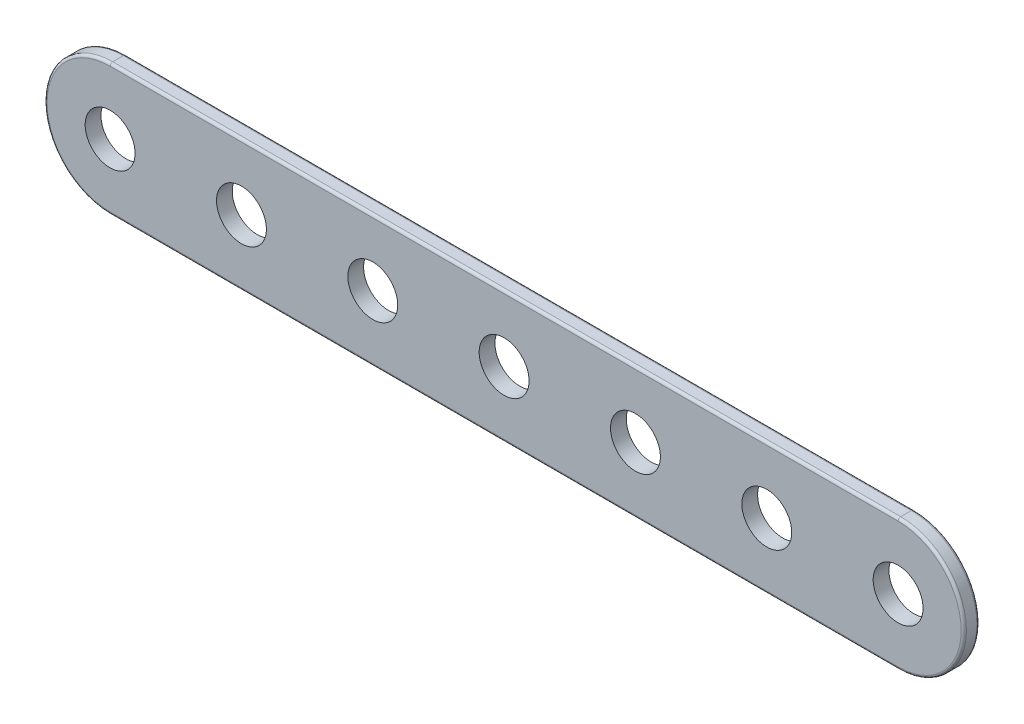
ISO-10303-21;
HEADER;
FILE_DESCRIPTION(('STEP AP214'),'2;1');
FILE_NAME('part.step','',(''),(''),'','','');
FILE_SCHEMA(('AUTOMOTIVE_DESIGN { 1 0 10303 214 1 1 1 1 }'));
ENDSEC;
DATA;
#1=APPLICATION_CONTEXT('core data for automotive mechanical design processes');
#2=APPLICATION_PROTOCOL_DEFINITION('international standard','automotive_design',2000,#1);
#3=PRODUCT_CONTEXT('',#1,'mechanical');
#4=PRODUCT('Part','Part','',(#3));
#5=PRODUCT_RELATED_PRODUCT_CATEGORY('part','',(#4));
#6=PRODUCT_DEFINITION_FORMATION('','',#4);
#7=PRODUCT_DEFINITION_CONTEXT('part definition',#1,'design');
#8=PRODUCT_DEFINITION('design','',#6,#7);
#9=PRODUCT_DEFINITION_SHAPE('','',#8);
#10=(LENGTH_UNIT() NAMED_UNIT(*) SI_UNIT(.MILLI.,.METRE.));
#11=(NAMED_UNIT(*) PLANE_ANGLE_UNIT() SI_UNIT($,.RADIAN.));
#12=(NAMED_UNIT(*) SI_UNIT($,.STERADIAN.) SOLID_ANGLE_UNIT());
#13=UNCERTAINTY_MEASURE_WITH_UNIT(LENGTH_MEASURE(1.E-05),#10,'distance_accuracy_value','');
#14=(GEOMETRIC_REPRESENTATION_CONTEXT(3) GLOBAL_UNCERTAINTY_ASSIGNED_CONTEXT((#13)) GLOBAL_UNIT_ASSIGNED_CONTEXT((#10,
#11,#12)) REPRESENTATION_CONTEXT('',''));
#15=CARTESIAN_POINT('',(0.,0.,0.));
#16=DIRECTION('',(0.,0.,1.));
#17=DIRECTION('',(1.,0.,0.));
#18=AXIS2_PLACEMENT_3D('',#15,#16,#17);
#19=CARTESIAN_POINT('',(38.1,0.,1.524));
#20=DIRECTION('',(0.,0.,-1.));
#21=DIRECTION('',(-1.,0.,0.));
#22=AXIS2_PLACEMENT_3D('',#19,#20,#21);
#23=CYLINDRICAL_SURFACE('',#22,6.35);
#24=DIRECTION('',(0.,0.,-1.));
#25=VECTOR('',#24,1.);
#26=CARTESIAN_POINT('',(38.1,-6.35,1.524));
#27=LINE('',#26,#25);
#28=CARTESIAN_POINT('',(38.1,-6.35,1.27));
#29=VERTEX_POINT('',#28);
#30=CARTESIAN_POINT('',(38.1,-6.35,0.254000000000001));
#31=VERTEX_POINT('',#30);
#32=EDGE_CURVE('E199',#29,#31,#27,.T.);
#33=ORIENTED_EDGE('',*,*,#32,.T.);
#34=CARTESIAN_POINT('',(38.1,0.,0.254));
#35=DIRECTION('',(0.,0.,-1.));
#36=DIRECTION('',(-1.,0.,0.));
#37=AXIS2_PLACEMENT_3D('',#34,#35,#36);
#38=CIRCLE('',#37,6.35);
#39=CARTESIAN_POINT('',(38.1,6.35000000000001,0.254000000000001));
#40=VERTEX_POINT('',#39);
#41=EDGE_CURVE('E118',#31,#40,#38,.F.);
#42=ORIENTED_EDGE('',*,*,#41,.T.);
#43=DIRECTION('',(0.,0.,-1.));
#44=VECTOR('',#43,1.);
#45=CARTESIAN_POINT('',(38.1,6.35000000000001,1.524));
#46=LINE('',#45,#44);
#47=CARTESIAN_POINT('',(38.1,6.35000000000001,1.27));
#48=VERTEX_POINT('',#47);
#49=EDGE_CURVE('E101',#48,#40,#46,.T.);
#50=ORIENTED_EDGE('',*,*,#49,.F.);
#51=CARTESIAN_POINT('',(38.1,0.,1.27));
#52=DIRECTION('',(0.,0.,-1.));
#53=DIRECTION('',(-1.,0.,0.));
#54=AXIS2_PLACEMENT_3D('',#51,#52,#53);
#55=CIRCLE('',#54,6.35);
#56=EDGE_CURVE('E115',#48,#29,#55,.T.);
#57=ORIENTED_EDGE('',*,*,#56,.T.);
#58=EDGE_LOOP('',(#33,#42,#50,#57));
#59=FACE_BOUND('',#58,.T.);
#60=ADVANCED_FACE('F32',(#59),#23,.T.);
#61=CARTESIAN_POINT('',(-38.1,6.35000000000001,1.524));
#62=DIRECTION('',(0.,-1.,0.));
#63=DIRECTION('',(0.,0.,-1.));
#64=AXIS2_PLACEMENT_3D('',#61,#62,#63);
#65=PLANE('',#64);
#66=ORIENTED_EDGE('',*,*,#49,.T.);
#67=DIRECTION('',(-1.,0.,0.));
#68=VECTOR('',#67,1.);
#69=CARTESIAN_POINT('',(-38.1,6.35000000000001,0.254));
#70=LINE('',#69,#68);
#71=CARTESIAN_POINT('',(-38.1,6.35000000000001,0.254000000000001));
#72=VERTEX_POINT('',#71);
#73=EDGE_CURVE('E11',#40,#72,#70,.T.);
#74=ORIENTED_EDGE('',*,*,#73,.T.);
#75=DIRECTION('',(0.,0.,-1.));
#76=VECTOR('',#75,1.);
#77=CARTESIAN_POINT('',(-38.1,6.35000000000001,1.524));
#78=LINE('',#77,#76);
#79=CARTESIAN_POINT('',(-38.1,6.35000000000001,1.27));
#80=VERTEX_POINT('',#79);
#81=EDGE_CURVE('E103',#80,#72,#78,.T.);
#82=ORIENTED_EDGE('',*,*,#81,.F.);
#83=DIRECTION('',(-1.,0.,0.));
#84=VECTOR('',#83,1.);
#85=CARTESIAN_POINT('',(-38.1,6.35000000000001,1.27));
#86=LINE('',#85,#84);
#87=EDGE_CURVE('E41',#80,#48,#86,.F.);
#88=ORIENTED_EDGE('',*,*,#87,.T.);
#89=EDGE_LOOP('',(#66,#74,#82,#88));
#90=FACE_BOUND('',#89,.T.);
#91=ADVANCED_FACE('F100',(#90),#65,.F.);
#92=CARTESIAN_POINT('',(-38.1,0.,1.524));
#93=DIRECTION('',(0.,0.,-1.));
#94=DIRECTION('',(-1.,0.,0.));
#95=AXIS2_PLACEMENT_3D('',#92,#93,#94);
#96=CYLINDRICAL_SURFACE('',#95,6.35);
#97=ORIENTED_EDGE('',*,*,#81,.T.);
#98=CARTESIAN_POINT('',(-38.1,0.,0.254));
#99=DIRECTION('',(0.,0.,-1.));
#100=DIRECTION('',(-1.,0.,0.));
#101=AXIS2_PLACEMENT_3D('',#98,#99,#100);
#102=CIRCLE('',#101,6.35);
#103=CARTESIAN_POINT('',(-38.1,-6.35,0.254000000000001));
#104=VERTEX_POINT('',#103);
#105=EDGE_CURVE('E223',#72,#104,#102,.F.);
#106=ORIENTED_EDGE('',*,*,#105,.T.);
#107=DIRECTION('',(0.,0.,-1.));
#108=VECTOR('',#107,1.);
#109=CARTESIAN_POINT('',(-38.1,-6.35,1.524));
#110=LINE('',#109,#108);
#111=CARTESIAN_POINT('',(-38.1,-6.35,1.27));
#112=VERTEX_POINT('',#111);
#113=EDGE_CURVE('E203',#112,#104,#110,.T.);
#114=ORIENTED_EDGE('',*,*,#113,.F.);
#115=CARTESIAN_POINT('',(-38.1,0.,1.27));
#116=DIRECTION('',(0.,0.,-1.));
#117=DIRECTION('',(-1.,0.,0.));
#118=AXIS2_PLACEMENT_3D('',#115,#116,#117);
#119=CIRCLE('',#118,6.35);
#120=EDGE_CURVE('E221',#112,#80,#119,.T.);
#121=ORIENTED_EDGE('',*,*,#120,.T.);
#122=EDGE_LOOP('',(#97,#106,#114,#121));
#123=FACE_BOUND('',#122,.T.);
#124=ADVANCED_FACE('F237',(#123),#96,.T.);
#125=CARTESIAN_POINT('',(-38.1,-6.35,1.524));
#126=DIRECTION('',(0.,1.,0.));
#127=DIRECTION('',(0.,0.,1.));
#128=AXIS2_PLACEMENT_3D('',#125,#126,#127);
#129=PLANE('',#128);
#130=ORIENTED_EDGE('',*,*,#113,.T.);
#131=DIRECTION('',(1.,0.,0.));
#132=VECTOR('',#131,1.);
#133=CARTESIAN_POINT('',(38.1,-6.35,0.254));
#134=LINE('',#133,#132);
#135=EDGE_CURVE('E219',#104,#31,#134,.T.);
#136=ORIENTED_EDGE('',*,*,#135,.T.);
#137=ORIENTED_EDGE('',*,*,#32,.F.);
#138=DIRECTION('',(1.,0.,0.));
#139=VECTOR('',#138,1.);
#140=CARTESIAN_POINT('',(-38.1,-6.35,1.27));
#141=LINE('',#140,#139);
#142=EDGE_CURVE('E217',#29,#112,#141,.F.);
#143=ORIENTED_EDGE('',*,*,#142,.T.);
#144=EDGE_LOOP('',(#130,#136,#137,#143));
#145=FACE_BOUND('',#144,.T.);
#146=ADVANCED_FACE('F235',(#145),#129,.F.);
#147=CARTESIAN_POINT('',(38.1,0.,1.524));
#148=DIRECTION('',(0.,0.,-1.));
#149=DIRECTION('',(-1.,0.,0.));
#150=AXIS2_PLACEMENT_3D('',#147,#148,#149);
#151=PLANE('',#150);
#152=DIRECTION('',(1.,0.,0.));
#153=VECTOR('',#152,1.);
#154=CARTESIAN_POINT('',(38.1,-6.096,1.524));
#155=LINE('',#154,#153);
#156=CARTESIAN_POINT('',(-38.1,-6.096,1.524));
#157=VERTEX_POINT('',#156);
#158=CARTESIAN_POINT('',(38.1,-6.096,1.524));
#159=VERTEX_POINT('',#158);
#160=EDGE_CURVE('E49',#157,#159,#155,.T.);
#161=ORIENTED_EDGE('',*,*,#160,.T.);
#162=CARTESIAN_POINT('',(38.1,0.,1.524));
#163=DIRECTION('',(0.,0.,-1.));
#164=DIRECTION('',(-1.,0.,0.));
#165=AXIS2_PLACEMENT_3D('',#162,#163,#164);
#166=CIRCLE('',#165,6.09600000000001);
#167=CARTESIAN_POINT('',(38.1,6.09600000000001,1.524));
#168=VERTEX_POINT('',#167);
#169=EDGE_CURVE('E108',#159,#168,#166,.F.);
#170=ORIENTED_EDGE('',*,*,#169,.T.);
#171=DIRECTION('',(-1.,0.,0.));
#172=VECTOR('',#171,1.);
#173=CARTESIAN_POINT('',(38.1,6.09600000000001,1.524));
#174=LINE('',#173,#172);
#175=CARTESIAN_POINT('',(-38.1,6.09600000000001,1.524));
#176=VERTEX_POINT('',#175);
#177=EDGE_CURVE('E129',#168,#176,#174,.T.);
#178=ORIENTED_EDGE('',*,*,#177,.T.);
#179=CARTESIAN_POINT('',(-38.1,0.,1.524));
#180=DIRECTION('',(0.,0.,-1.));
#181=DIRECTION('',(-1.,0.,0.));
#182=AXIS2_PLACEMENT_3D('',#179,#180,#181);
#183=CIRCLE('',#182,6.09600000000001);
#184=EDGE_CURVE('E54',#176,#157,#183,.F.);
#185=ORIENTED_EDGE('',*,*,#184,.T.);
#186=EDGE_LOOP('',(#161,#170,#178,#185));
#187=FACE_BOUND('',#186,.T.);
#188=CARTESIAN_POINT('',(38.1,0.,1.524));
#189=DIRECTION('',(0.,0.,1.));
#190=DIRECTION('',(1.,0.,0.));
#191=AXIS2_PLACEMENT_3D('',#188,#189,#190);
#192=CIRCLE('',#191,2.413);
#193=CARTESIAN_POINT('',(40.513,0.,1.524));
#194=VERTEX_POINT('',#193);
#195=EDGE_CURVE('E158',#194,#194,#192,.T.);
#196=ORIENTED_EDGE('',*,*,#195,.F.);
#197=EDGE_LOOP('',(#196));
#198=FACE_BOUND('',#197,.T.);
#199=CARTESIAN_POINT('',(25.4,0.,1.524));
#200=DIRECTION('',(0.,0.,1.));
#201=DIRECTION('',(1.,0.,0.));
#202=AXIS2_PLACEMENT_3D('',#199,#200,#201);
#203=CIRCLE('',#202,2.413);
#204=CARTESIAN_POINT('',(27.813,0.,1.524));
#205=VERTEX_POINT('',#204);
#206=EDGE_CURVE('E168',#205,#205,#203,.T.);
#207=ORIENTED_EDGE('',*,*,#206,.F.);
#208=EDGE_LOOP('',(#207));
#209=FACE_BOUND('',#208,.T.);
#210=CARTESIAN_POINT('',(12.7,0.,1.524));
#211=DIRECTION('',(0.,0.,1.));
#212=DIRECTION('',(1.,0.,0.));
#213=AXIS2_PLACEMENT_3D('',#210,#211,#212);
#214=CIRCLE('',#213,2.413);
#215=CARTESIAN_POINT('',(15.113,0.,1.524));
#216=VERTEX_POINT('',#215);
#217=EDGE_CURVE('E174',#216,#216,#214,.T.);
#218=ORIENTED_EDGE('',*,*,#217,.F.);
#219=EDGE_LOOP('',(#218));
#220=FACE_BOUND('',#219,.T.);
#221=CARTESIAN_POINT('',(0.,0.,1.524));
#222=DIRECTION('',(0.,0.,1.));
#223=DIRECTION('',(1.,0.,0.));
#224=AXIS2_PLACEMENT_3D('',#221,#222,#223);
#225=CIRCLE('',#224,2.413);
#226=CARTESIAN_POINT('',(2.41300000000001,0.,1.524));
#227=VERTEX_POINT('',#226);
#228=EDGE_CURVE('E180',#227,#227,#225,.T.);
#229=ORIENTED_EDGE('',*,*,#228,.F.);
#230=EDGE_LOOP('',(#229));
#231=FACE_BOUND('',#230,.T.);
#232=CARTESIAN_POINT('',(-12.7,0.,1.524));
#233=DIRECTION('',(0.,0.,1.));
#234=DIRECTION('',(1.,0.,0.));
#235=AXIS2_PLACEMENT_3D('',#232,#233,#234);
#236=CIRCLE('',#235,2.413);
#237=CARTESIAN_POINT('',(-10.287,0.,1.524));
#238=VERTEX_POINT('',#237);
#239=EDGE_CURVE('E186',#238,#238,#236,.T.);
#240=ORIENTED_EDGE('',*,*,#239,.F.);
#241=EDGE_LOOP('',(#240));
#242=FACE_BOUND('',#241,.T.);
#243=CARTESIAN_POINT('',(-25.4,0.,1.524));
#244=DIRECTION('',(0.,0.,1.));
#245=DIRECTION('',(1.,0.,0.));
#246=AXIS2_PLACEMENT_3D('',#243,#244,#245);
#247=CIRCLE('',#246,2.413);
#248=CARTESIAN_POINT('',(-22.987,0.,1.524));
#249=VERTEX_POINT('',#248);
#250=EDGE_CURVE('E192',#249,#249,#247,.T.);
#251=ORIENTED_EDGE('',*,*,#250,.F.);
#252=EDGE_LOOP('',(#251));
#253=FACE_BOUND('',#252,.T.);
#254=CARTESIAN_POINT('',(-38.1,0.,1.524));
#255=DIRECTION('',(0.,0.,1.));
#256=DIRECTION('',(1.,0.,0.));
#257=AXIS2_PLACEMENT_3D('',#254,#255,#256);
#258=CIRCLE('',#257,2.413);
#259=CARTESIAN_POINT('',(-35.687,0.,1.524));
#260=VERTEX_POINT('',#259);
#261=EDGE_CURVE('E195',#260,#260,#258,.T.);
#262=ORIENTED_EDGE('',*,*,#261,.F.);
#263=EDGE_LOOP('',(#262));
#264=FACE_BOUND('',#263,.T.);
#265=ADVANCED_FACE('F228',(#187,#198,#209,#220,#231,#242,#253,#264),#151,.F.);
#266=CARTESIAN_POINT('',(38.1,0.,0.));
#267=DIRECTION('',(0.,0.,-1.));
#268=DIRECTION('',(-1.,0.,0.));
#269=AXIS2_PLACEMENT_3D('',#266,#267,#268);
#270=PLANE('',#269);
#271=DIRECTION('',(-1.,0.,0.));
#272=VECTOR('',#271,1.);
#273=CARTESIAN_POINT('',(38.1,6.09600000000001,0.));
#274=LINE('',#273,#272);
#275=CARTESIAN_POINT('',(-38.1,6.09600000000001,0.));
#276=VERTEX_POINT('',#275);
#277=CARTESIAN_POINT('',(38.1,6.09600000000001,0.));
#278=VERTEX_POINT('',#277);
#279=EDGE_CURVE('E208',#276,#278,#274,.F.);
#280=ORIENTED_EDGE('',*,*,#279,.T.);
#281=CARTESIAN_POINT('',(38.1,0.,0.));
#282=DIRECTION('',(0.,0.,-1.));
#283=DIRECTION('',(-1.,0.,0.));
#284=AXIS2_PLACEMENT_3D('',#281,#282,#283);
#285=CIRCLE('',#284,6.09600000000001);
#286=CARTESIAN_POINT('',(38.1,-6.096,0.));
#287=VERTEX_POINT('',#286);
#288=EDGE_CURVE('E214',#278,#287,#285,.T.);
#289=ORIENTED_EDGE('',*,*,#288,.T.);
#290=DIRECTION('',(1.,0.,0.));
#291=VECTOR('',#290,1.);
#292=CARTESIAN_POINT('',(-38.1,-6.096,0.));
#293=LINE('',#292,#291);
#294=CARTESIAN_POINT('',(-38.1,-6.096,0.));
#295=VERTEX_POINT('',#294);
#296=EDGE_CURVE('E212',#287,#295,#293,.F.);
#297=ORIENTED_EDGE('',*,*,#296,.T.);
#298=CARTESIAN_POINT('',(-38.1,0.,0.));
#299=DIRECTION('',(0.,0.,-1.));
#300=DIRECTION('',(-1.,0.,0.));
#301=AXIS2_PLACEMENT_3D('',#298,#299,#300);
#302=CIRCLE('',#301,6.09600000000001);
#303=EDGE_CURVE('E210',#295,#276,#302,.T.);
#304=ORIENTED_EDGE('',*,*,#303,.T.);
#305=EDGE_LOOP('',(#280,#289,#297,#304));
#306=FACE_BOUND('',#305,.T.);
#307=CARTESIAN_POINT('',(38.1,0.,0.));
#308=DIRECTION('',(0.,0.,1.));
#309=DIRECTION('',(1.,0.,0.));
#310=AXIS2_PLACEMENT_3D('',#307,#308,#309);
#311=CIRCLE('',#310,2.413);
#312=CARTESIAN_POINT('',(40.513,0.,0.));
#313=VERTEX_POINT('',#312);
#314=EDGE_CURVE('E152',#313,#313,#311,.T.);
#315=ORIENTED_EDGE('',*,*,#314,.T.);
#316=EDGE_LOOP('',(#315));
#317=FACE_BOUND('',#316,.T.);
#318=CARTESIAN_POINT('',(25.4,0.,0.));
#319=DIRECTION('',(0.,0.,1.));
#320=DIRECTION('',(1.,0.,0.));
#321=AXIS2_PLACEMENT_3D('',#318,#319,#320);
#322=CIRCLE('',#321,2.413);
#323=CARTESIAN_POINT('',(27.813,0.,0.));
#324=VERTEX_POINT('',#323);
#325=EDGE_CURVE('E163',#324,#324,#322,.T.);
#326=ORIENTED_EDGE('',*,*,#325,.T.);
#327=EDGE_LOOP('',(#326));
#328=FACE_BOUND('',#327,.T.);
#329=CARTESIAN_POINT('',(12.7,0.,0.));
#330=DIRECTION('',(0.,0.,1.));
#331=DIRECTION('',(1.,0.,0.));
#332=AXIS2_PLACEMENT_3D('',#329,#330,#331);
#333=CIRCLE('',#332,2.413);
#334=CARTESIAN_POINT('',(15.113,0.,0.));
#335=VERTEX_POINT('',#334);
#336=EDGE_CURVE('E171',#335,#335,#333,.T.);
#337=ORIENTED_EDGE('',*,*,#336,.T.);
#338=EDGE_LOOP('',(#337));
#339=FACE_BOUND('',#338,.T.);
#340=CARTESIAN_POINT('',(0.,0.,0.));
#341=DIRECTION('',(0.,0.,1.));
#342=DIRECTION('',(1.,0.,0.));
#343=AXIS2_PLACEMENT_3D('',#340,#341,#342);
#344=CIRCLE('',#343,2.413);
#345=CARTESIAN_POINT('',(2.41300000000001,0.,0.));
#346=VERTEX_POINT('',#345);
#347=EDGE_CURVE('E177',#346,#346,#344,.T.);
#348=ORIENTED_EDGE('',*,*,#347,.T.);
#349=EDGE_LOOP('',(#348));
#350=FACE_BOUND('',#349,.T.);
#351=CARTESIAN_POINT('',(-12.7,0.,0.));
#352=DIRECTION('',(0.,0.,1.));
#353=DIRECTION('',(1.,0.,0.));
#354=AXIS2_PLACEMENT_3D('',#351,#352,#353);
#355=CIRCLE('',#354,2.413);
#356=CARTESIAN_POINT('',(-10.287,0.,0.));
#357=VERTEX_POINT('',#356);
#358=EDGE_CURVE('E183',#357,#357,#355,.T.);
#359=ORIENTED_EDGE('',*,*,#358,.T.);
#360=EDGE_LOOP('',(#359));
#361=FACE_BOUND('',#360,.T.);
#362=CARTESIAN_POINT('',(-25.4,0.,0.));
#363=DIRECTION('',(0.,0.,1.));
#364=DIRECTION('',(1.,0.,0.));
#365=AXIS2_PLACEMENT_3D('',#362,#363,#364);
#366=CIRCLE('',#365,2.413);
#367=CARTESIAN_POINT('',(-22.987,0.,0.));
#368=VERTEX_POINT('',#367);
#369=EDGE_CURVE('E189',#368,#368,#366,.T.);
#370=ORIENTED_EDGE('',*,*,#369,.T.);
#371=EDGE_LOOP('',(#370));
#372=FACE_BOUND('',#371,.T.);
#373=CARTESIAN_POINT('',(-38.1,0.,0.));
#374=DIRECTION('',(0.,0.,1.));
#375=DIRECTION('',(1.,0.,0.));
#376=AXIS2_PLACEMENT_3D('',#373,#374,#375);
#377=CIRCLE('',#376,2.413);
#378=CARTESIAN_POINT('',(-35.687,0.,0.));
#379=VERTEX_POINT('',#378);
#380=EDGE_CURVE('E196',#379,#379,#377,.T.);
#381=ORIENTED_EDGE('',*,*,#380,.T.);
#382=EDGE_LOOP('',(#381));
#383=FACE_BOUND('',#382,.T.);
#384=ADVANCED_FACE('F264',(#306,#317,#328,#339,#350,#361,#372,#383),#270,.T.);
#385=CARTESIAN_POINT('',(-38.1,0.,0.));
#386=DIRECTION('',(0.,0.,1.));
#387=DIRECTION('',(1.,0.,0.));
#388=AXIS2_PLACEMENT_3D('',#385,#386,#387);
#389=CYLINDRICAL_SURFACE('',#388,2.413);
#390=CARTESIAN_POINT('',(-35.687,0.,0.));
#391=CARTESIAN_POINT('',(-35.687,0.,0.015875));
#392=CARTESIAN_POINT('',(-35.687,0.,0.03175));
#393=CARTESIAN_POINT('',(-35.687,0.,0.0635));
#394=CARTESIAN_POINT('',(-35.687,0.,0.079375));
#395=CARTESIAN_POINT('',(-35.687,0.,0.111125));
#396=CARTESIAN_POINT('',(-35.687,0.,0.127));
#397=CARTESIAN_POINT('',(-35.687,0.,0.15875));
#398=CARTESIAN_POINT('',(-35.687,0.,0.174625));
#399=CARTESIAN_POINT('',(-35.687,0.,0.206375));
#400=CARTESIAN_POINT('',(-35.687,0.,0.22225));
#401=CARTESIAN_POINT('',(-35.687,0.,0.254));
#402=CARTESIAN_POINT('',(-35.687,0.,0.269875));
#403=CARTESIAN_POINT('',(-35.687,0.,0.301625));
#404=CARTESIAN_POINT('',(-35.687,0.,0.3175));
#405=CARTESIAN_POINT('',(-35.687,0.,0.34925));
#406=CARTESIAN_POINT('',(-35.687,0.,0.365125));
#407=CARTESIAN_POINT('',(-35.687,0.,0.396875));
#408=CARTESIAN_POINT('',(-35.687,0.,0.41275));
#409=CARTESIAN_POINT('',(-35.687,0.,0.4445));
#410=CARTESIAN_POINT('',(-35.687,0.,0.460375));
#411=CARTESIAN_POINT('',(-35.687,0.,0.492125));
#412=CARTESIAN_POINT('',(-35.687,0.,0.508));
#413=CARTESIAN_POINT('',(-35.687,0.,0.53975));
#414=CARTESIAN_POINT('',(-35.687,0.,0.555625));
#415=CARTESIAN_POINT('',(-35.687,0.,0.587375));
#416=CARTESIAN_POINT('',(-35.687,0.,0.60325));
#417=CARTESIAN_POINT('',(-35.687,0.,0.635));
#418=CARTESIAN_POINT('',(-35.687,0.,0.650875));
#419=CARTESIAN_POINT('',(-35.687,0.,0.682625));
#420=CARTESIAN_POINT('',(-35.687,0.,0.6985));
#421=CARTESIAN_POINT('',(-35.687,0.,0.73025));
#422=CARTESIAN_POINT('',(-35.687,0.,0.746125));
#423=CARTESIAN_POINT('',(-35.687,0.,0.777875));
#424=CARTESIAN_POINT('',(-35.687,0.,0.79375));
#425=CARTESIAN_POINT('',(-35.687,0.,0.8255));
#426=CARTESIAN_POINT('',(-35.687,0.,0.841375));
#427=CARTESIAN_POINT('',(-35.687,0.,0.873125));
#428=CARTESIAN_POINT('',(-35.687,0.,0.889));
#429=CARTESIAN_POINT('',(-35.687,0.,0.92075));
#430=CARTESIAN_POINT('',(-35.687,0.,0.936625));
#431=CARTESIAN_POINT('',(-35.687,0.,0.968375));
#432=CARTESIAN_POINT('',(-35.687,0.,0.98425));
#433=CARTESIAN_POINT('',(-35.687,0.,1.016));
#434=CARTESIAN_POINT('',(-35.687,0.,1.031875));
#435=CARTESIAN_POINT('',(-35.687,0.,1.063625));
#436=CARTESIAN_POINT('',(-35.687,0.,1.0795));
#437=CARTESIAN_POINT('',(-35.687,0.,1.11125));
#438=CARTESIAN_POINT('',(-35.687,0.,1.127125));
#439=CARTESIAN_POINT('',(-35.687,0.,1.158875));
#440=CARTESIAN_POINT('',(-35.687,0.,1.17475));
#441=CARTESIAN_POINT('',(-35.687,0.,1.2065));
#442=CARTESIAN_POINT('',(-35.687,0.,1.222375));
#443=CARTESIAN_POINT('',(-35.687,0.,1.254125));
#444=CARTESIAN_POINT('',(-35.687,0.,1.27));
#445=CARTESIAN_POINT('',(-35.687,0.,1.30175));
#446=CARTESIAN_POINT('',(-35.687,0.,1.317625));
#447=CARTESIAN_POINT('',(-35.687,0.,1.349375));
#448=CARTESIAN_POINT('',(-35.687,0.,1.36525));
#449=CARTESIAN_POINT('',(-35.687,0.,1.397));
#450=CARTESIAN_POINT('',(-35.687,0.,1.412875));
#451=CARTESIAN_POINT('',(-35.687,0.,1.444625));
#452=CARTESIAN_POINT('',(-35.687,0.,1.4605));
#453=CARTESIAN_POINT('',(-35.687,0.,1.49225));
#454=CARTESIAN_POINT('',(-35.687,0.,1.508125));
#455=CARTESIAN_POINT('',(-35.687,0.,1.524));
#456=B_SPLINE_CURVE_WITH_KNOTS('',3,(#390,#391,#392,#393,#394,#395,#396,#397,#398,#399,#400,
#401,#402,#403,#404,#405,#406,#407,#408,#409,#410,#411,#412,#413,#414,#415,#416,#417,#418,#419,
#420,#421,#422,#423,#424,#425,#426,#427,#428,#429,#430,#431,#432,#433,#434,#435,#436,#437,#438,
#439,#440,#441,#442,#443,#444,#445,#446,#447,#448,#449,#450,#451,#452,#453,#454,#455),
.UNSPECIFIED.,.F.,.F.,(4,2,2,2,2,2,2,2,2,2,2,2,2,2,2,2,2,2,2,2,2,2,2,2,2,2,2,2,2,2,2,2,4),(0.,
0.047625,0.09525,0.142875,0.1905,0.238125,0.28575,0.333375,0.381,0.428625,0.47625,0.523875,
0.5715,0.619125,0.66675,0.714375,0.762,0.809625,0.85725,0.904875,0.9525,1.000125,1.04775,
1.095375,1.143,1.190625,1.23825,1.285875,1.3335,1.381125,1.42875,1.476375,1.524),.UNSPECIFIED.);
#457=EDGE_CURVE('BSEAM267',#379,#260,#456,.T.);
#458=ORIENTED_EDGE('',*,*,#380,.F.);
#459=ORIENTED_EDGE('',*,*,#261,.T.);
#460=ORIENTED_EDGE('',*,*,#457,.T.);
#461=ORIENTED_EDGE('',*,*,#457,.F.);
#462=EDGE_LOOP('',(#458,#460,#459,#461));
#463=FACE_BOUND('',#462,.T.);
#464=ADVANCED_FACE('F267',(#463),#389,.F.);
#465=CARTESIAN_POINT('',(-25.4,0.,0.));
#466=DIRECTION('',(0.,0.,1.));
#467=DIRECTION('',(1.,0.,0.));
#468=AXIS2_PLACEMENT_3D('',#465,#466,#467);
#469=CYLINDRICAL_SURFACE('',#468,2.413);
#470=CARTESIAN_POINT('',(-22.987,0.,0.));
#471=CARTESIAN_POINT('',(-22.987,0.,0.015875));
#472=CARTESIAN_POINT('',(-22.987,0.,0.03175));
#473=CARTESIAN_POINT('',(-22.987,0.,0.0635));
#474=CARTESIAN_POINT('',(-22.987,0.,0.079375));
#475=CARTESIAN_POINT('',(-22.987,0.,0.111125));
#476=CARTESIAN_POINT('',(-22.987,0.,0.127));
#477=CARTESIAN_POINT('',(-22.987,0.,0.15875));
#478=CARTESIAN_POINT('',(-22.987,0.,0.174625));
#479=CARTESIAN_POINT('',(-22.987,0.,0.206375));
#480=CARTESIAN_POINT('',(-22.987,0.,0.22225));
#481=CARTESIAN_POINT('',(-22.987,0.,0.254));
#482=CARTESIAN_POINT('',(-22.987,0.,0.269875));
#483=CARTESIAN_POINT('',(-22.987,0.,0.301625));
#484=CARTESIAN_POINT('',(-22.987,0.,0.3175));
#485=CARTESIAN_POINT('',(-22.987,0.,0.34925));
#486=CARTESIAN_POINT('',(-22.987,0.,0.365125));
#487=CARTESIAN_POINT('',(-22.987,0.,0.396875));
#488=CARTESIAN_POINT('',(-22.987,0.,0.41275));
#489=CARTESIAN_POINT('',(-22.987,0.,0.4445));
#490=CARTESIAN_POINT('',(-22.987,0.,0.460375));
#491=CARTESIAN_POINT('',(-22.987,0.,0.492125));
#492=CARTESIAN_POINT('',(-22.987,0.,0.508));
#493=CARTESIAN_POINT('',(-22.987,0.,0.53975));
#494=CARTESIAN_POINT('',(-22.987,0.,0.555625));
#495=CARTESIAN_POINT('',(-22.987,0.,0.587375));
#496=CARTESIAN_POINT('',(-22.987,0.,0.60325));
#497=CARTESIAN_POINT('',(-22.987,0.,0.635));
#498=CARTESIAN_POINT('',(-22.987,0.,0.650875));
#499=CARTESIAN_POINT('',(-22.987,0.,0.682625));
#500=CARTESIAN_POINT('',(-22.987,0.,0.6985));
#501=CARTESIAN_POINT('',(-22.987,0.,0.73025));
#502=CARTESIAN_POINT('',(-22.987,0.,0.746125));
#503=CARTESIAN_POINT('',(-22.987,0.,0.777875));
#504=CARTESIAN_POINT('',(-22.987,0.,0.79375));
#505=CARTESIAN_POINT('',(-22.987,0.,0.8255));
#506=CARTESIAN_POINT('',(-22.987,0.,0.841375));
#507=CARTESIAN_POINT('',(-22.987,0.,0.873125));
#508=CARTESIAN_POINT('',(-22.987,0.,0.889));
#509=CARTESIAN_POINT('',(-22.987,0.,0.92075));
#510=CARTESIAN_POINT('',(-22.987,0.,0.936625));
#511=CARTESIAN_POINT('',(-22.987,0.,0.968375));
#512=CARTESIAN_POINT('',(-22.987,0.,0.98425));
#513=CARTESIAN_POINT('',(-22.987,0.,1.016));
#514=CARTESIAN_POINT('',(-22.987,0.,1.031875));
#515=CARTESIAN_POINT('',(-22.987,0.,1.063625));
#516=CARTESIAN_POINT('',(-22.987,0.,1.0795));
#517=CARTESIAN_POINT('',(-22.987,0.,1.11125));
#518=CARTESIAN_POINT('',(-22.987,0.,1.127125));
#519=CARTESIAN_POINT('',(-22.987,0.,1.158875));
#520=CARTESIAN_POINT('',(-22.987,0.,1.17475));
#521=CARTESIAN_POINT('',(-22.987,0.,1.2065));
#522=CARTESIAN_POINT('',(-22.987,0.,1.222375));
#523=CARTESIAN_POINT('',(-22.987,0.,1.254125));
#524=CARTESIAN_POINT('',(-22.987,0.,1.27));
#525=CARTESIAN_POINT('',(-22.987,0.,1.30175));
#526=CARTESIAN_POINT('',(-22.987,0.,1.317625));
#527=CARTESIAN_POINT('',(-22.987,0.,1.349375));
#528=CARTESIAN_POINT('',(-22.987,0.,1.36525));
#529=CARTESIAN_POINT('',(-22.987,0.,1.397));
#530=CARTESIAN_POINT('',(-22.987,0.,1.412875));
#531=CARTESIAN_POINT('',(-22.987,0.,1.444625));
#532=CARTESIAN_POINT('',(-22.987,0.,1.4605));
#533=CARTESIAN_POINT('',(-22.987,0.,1.49225));
#534=CARTESIAN_POINT('',(-22.987,0.,1.508125));
#535=CARTESIAN_POINT('',(-22.987,0.,1.524));
#536=B_SPLINE_CURVE_WITH_KNOTS('',3,(#470,#471,#472,#473,#474,#475,#476,#477,#478,#479,#480,
#481,#482,#483,#484,#485,#486,#487,#488,#489,#490,#491,#492,#493,#494,#495,#496,#497,#498,#499,
#500,#501,#502,#503,#504,#505,#506,#507,#508,#509,#510,#511,#512,#513,#514,#515,#516,#517,#518,
#519,#520,#521,#522,#523,#524,#525,#526,#527,#528,#529,#530,#531,#532,#533,#534,#535),
.UNSPECIFIED.,.F.,.F.,(4,2,2,2,2,2,2,2,2,2,2,2,2,2,2,2,2,2,2,2,2,2,2,2,2,2,2,2,2,2,2,2,4),(0.,
0.047625,0.09525,0.142875,0.1905,0.238125,0.28575,0.333375,0.381,0.428625,0.47625,0.523875,
0.5715,0.619125,0.66675,0.714375,0.762,0.809625,0.85725,0.904875,0.9525,1.000125,1.04775,
1.095375,1.143,1.190625,1.23825,1.285875,1.3335,1.381125,1.42875,1.476375,1.524),.UNSPECIFIED.);
#537=EDGE_CURVE('BSEAM273',#368,#249,#536,.T.);
#538=ORIENTED_EDGE('',*,*,#369,.F.);
#539=ORIENTED_EDGE('',*,*,#250,.T.);
#540=ORIENTED_EDGE('',*,*,#537,.T.);
#541=ORIENTED_EDGE('',*,*,#537,.F.);
#542=EDGE_LOOP('',(#538,#540,#539,#541));
#543=FACE_BOUND('',#542,.T.);
#544=ADVANCED_FACE('F273',(#543),#469,.F.);
#545=CARTESIAN_POINT('',(-12.7,0.,0.));
#546=DIRECTION('',(0.,0.,1.));
#547=DIRECTION('',(1.,0.,0.));
#548=AXIS2_PLACEMENT_3D('',#545,#546,#547);
#549=CYLINDRICAL_SURFACE('',#548,2.413);
#550=CARTESIAN_POINT('',(-10.287,0.,0.));
#551=CARTESIAN_POINT('',(-10.287,0.,0.015875));
#552=CARTESIAN_POINT('',(-10.287,0.,0.03175));
#553=CARTESIAN_POINT('',(-10.287,0.,0.0635));
#554=CARTESIAN_POINT('',(-10.287,0.,0.079375));
#555=CARTESIAN_POINT('',(-10.287,0.,0.111125));
#556=CARTESIAN_POINT('',(-10.287,0.,0.127));
#557=CARTESIAN_POINT('',(-10.287,0.,0.15875));
#558=CARTESIAN_POINT('',(-10.287,0.,0.174625));
#559=CARTESIAN_POINT('',(-10.287,0.,0.206375));
#560=CARTESIAN_POINT('',(-10.287,0.,0.22225));
#561=CARTESIAN_POINT('',(-10.287,0.,0.254));
#562=CARTESIAN_POINT('',(-10.287,0.,0.269875));
#563=CARTESIAN_POINT('',(-10.287,0.,0.301625));
#564=CARTESIAN_POINT('',(-10.287,0.,0.3175));
#565=CARTESIAN_POINT('',(-10.287,0.,0.34925));
#566=CARTESIAN_POINT('',(-10.287,0.,0.365125));
#567=CARTESIAN_POINT('',(-10.287,0.,0.396875));
#568=CARTESIAN_POINT('',(-10.287,0.,0.41275));
#569=CARTESIAN_POINT('',(-10.287,0.,0.4445));
#570=CARTESIAN_POINT('',(-10.287,0.,0.460375));
#571=CARTESIAN_POINT('',(-10.287,0.,0.492125));
#572=CARTESIAN_POINT('',(-10.287,0.,0.508));
#573=CARTESIAN_POINT('',(-10.287,0.,0.53975));
#574=CARTESIAN_POINT('',(-10.287,0.,0.555625));
#575=CARTESIAN_POINT('',(-10.287,0.,0.587375));
#576=CARTESIAN_POINT('',(-10.287,0.,0.60325));
#577=CARTESIAN_POINT('',(-10.287,0.,0.635));
#578=CARTESIAN_POINT('',(-10.287,0.,0.650875));
#579=CARTESIAN_POINT('',(-10.287,0.,0.682625));
#580=CARTESIAN_POINT('',(-10.287,0.,0.6985));
#581=CARTESIAN_POINT('',(-10.287,0.,0.73025));
#582=CARTESIAN_POINT('',(-10.287,0.,0.746125));
#583=CARTESIAN_POINT('',(-10.287,0.,0.777875));
#584=CARTESIAN_POINT('',(-10.287,0.,0.79375));
#585=CARTESIAN_POINT('',(-10.287,0.,0.8255));
#586=CARTESIAN_POINT('',(-10.287,0.,0.841375));
#587=CARTESIAN_POINT('',(-10.287,0.,0.873125));
#588=CARTESIAN_POINT('',(-10.287,0.,0.889));
#589=CARTESIAN_POINT('',(-10.287,0.,0.92075));
#590=CARTESIAN_POINT('',(-10.287,0.,0.936625));
#591=CARTESIAN_POINT('',(-10.287,0.,0.968375));
#592=CARTESIAN_POINT('',(-10.287,0.,0.98425));
#593=CARTESIAN_POINT('',(-10.287,0.,1.016));
#594=CARTESIAN_POINT('',(-10.287,0.,1.031875));
#595=CARTESIAN_POINT('',(-10.287,0.,1.063625));
#596=CARTESIAN_POINT('',(-10.287,0.,1.0795));
#597=CARTESIAN_POINT('',(-10.287,0.,1.11125));
#598=CARTESIAN_POINT('',(-10.287,0.,1.127125));
#599=CARTESIAN_POINT('',(-10.287,0.,1.158875));
#600=CARTESIAN_POINT('',(-10.287,0.,1.17475));
#601=CARTESIAN_POINT('',(-10.287,0.,1.2065));
#602=CARTESIAN_POINT('',(-10.287,0.,1.222375));
#603=CARTESIAN_POINT('',(-10.287,0.,1.254125));
#604=CARTESIAN_POINT('',(-10.287,0.,1.27));
#605=CARTESIAN_POINT('',(-10.287,0.,1.30175));
#606=CARTESIAN_POINT('',(-10.287,0.,1.317625));
#607=CARTESIAN_POINT('',(-10.287,0.,1.349375));
#608=CARTESIAN_POINT('',(-10.287,0.,1.36525));
#609=CARTESIAN_POINT('',(-10.287,0.,1.397));
#610=CARTESIAN_POINT('',(-10.287,0.,1.412875));
#611=CARTESIAN_POINT('',(-10.287,0.,1.444625));
#612=CARTESIAN_POINT('',(-10.287,0.,1.4605));
#613=CARTESIAN_POINT('',(-10.287,0.,1.49225));
#614=CARTESIAN_POINT('',(-10.287,0.,1.508125));
#615=CARTESIAN_POINT('',(-10.287,0.,1.524));
#616=B_SPLINE_CURVE_WITH_KNOTS('',3,(#550,#551,#552,#553,#554,#555,#556,#557,#558,#559,#560,
#561,#562,#563,#564,#565,#566,#567,#568,#569,#570,#571,#572,#573,#574,#575,#576,#577,#578,#579,
#580,#581,#582,#583,#584,#585,#586,#587,#588,#589,#590,#591,#592,#593,#594,#595,#596,#597,#598,
#599,#600,#601,#602,#603,#604,#605,#606,#607,#608,#609,#610,#611,#612,#613,#614,#615),
.UNSPECIFIED.,.F.,.F.,(4,2,2,2,2,2,2,2,2,2,2,2,2,2,2,2,2,2,2,2,2,2,2,2,2,2,2,2,2,2,2,2,4),(0.,
0.047625,0.09525,0.142875,0.1905,0.238125,0.28575,0.333375,0.381,0.428625,0.47625,0.523875,
0.5715,0.619125,0.66675,0.714375,0.762,0.809625,0.85725,0.904875,0.9525,1.000125,1.04775,
1.095375,1.143,1.190625,1.23825,1.285875,1.3335,1.381125,1.42875,1.476375,1.524),.UNSPECIFIED.);
#617=EDGE_CURVE('BSEAM277',#357,#238,#616,.T.);
#618=ORIENTED_EDGE('',*,*,#358,.F.);
#619=ORIENTED_EDGE('',*,*,#239,.T.);
#620=ORIENTED_EDGE('',*,*,#617,.T.);
#621=ORIENTED_EDGE('',*,*,#617,.F.);
#622=EDGE_LOOP('',(#618,#620,#619,#621));
#623=FACE_BOUND('',#622,.T.);
#624=ADVANCED_FACE('F277',(#623),#549,.F.);
#625=CARTESIAN_POINT('',(0.,0.,0.));
#626=DIRECTION('',(0.,0.,1.));
#627=DIRECTION('',(1.,0.,0.));
#628=AXIS2_PLACEMENT_3D('',#625,#626,#627);
#629=CYLINDRICAL_SURFACE('',#628,2.413);
#630=CARTESIAN_POINT('',(2.41300000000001,0.,0.));
#631=CARTESIAN_POINT('',(2.41300000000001,0.,0.015875));
#632=CARTESIAN_POINT('',(2.41300000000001,0.,0.03175));
#633=CARTESIAN_POINT('',(2.41300000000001,0.,0.0635));
#634=CARTESIAN_POINT('',(2.41300000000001,0.,0.079375));
#635=CARTESIAN_POINT('',(2.41300000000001,0.,0.111125));
#636=CARTESIAN_POINT('',(2.41300000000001,0.,0.127));
#637=CARTESIAN_POINT('',(2.41300000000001,0.,0.15875));
#638=CARTESIAN_POINT('',(2.41300000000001,0.,0.174625));
#639=CARTESIAN_POINT('',(2.41300000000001,0.,0.206375));
#640=CARTESIAN_POINT('',(2.41300000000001,0.,0.22225));
#641=CARTESIAN_POINT('',(2.41300000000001,0.,0.254));
#642=CARTESIAN_POINT('',(2.41300000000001,0.,0.269875));
#643=CARTESIAN_POINT('',(2.41300000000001,0.,0.301625));
#644=CARTESIAN_POINT('',(2.41300000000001,0.,0.3175));
#645=CARTESIAN_POINT('',(2.41300000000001,0.,0.34925));
#646=CARTESIAN_POINT('',(2.41300000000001,0.,0.365125));
#647=CARTESIAN_POINT('',(2.41300000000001,0.,0.396875));
#648=CARTESIAN_POINT('',(2.41300000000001,0.,0.41275));
#649=CARTESIAN_POINT('',(2.41300000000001,0.,0.4445));
#650=CARTESIAN_POINT('',(2.41300000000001,0.,0.460375));
#651=CARTESIAN_POINT('',(2.41300000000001,0.,0.492125));
#652=CARTESIAN_POINT('',(2.41300000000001,0.,0.508));
#653=CARTESIAN_POINT('',(2.41300000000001,0.,0.53975));
#654=CARTESIAN_POINT('',(2.41300000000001,0.,0.555625));
#655=CARTESIAN_POINT('',(2.41300000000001,0.,0.587375));
#656=CARTESIAN_POINT('',(2.41300000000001,0.,0.60325));
#657=CARTESIAN_POINT('',(2.41300000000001,0.,0.635));
#658=CARTESIAN_POINT('',(2.41300000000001,0.,0.650875));
#659=CARTESIAN_POINT('',(2.41300000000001,0.,0.682625));
#660=CARTESIAN_POINT('',(2.41300000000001,0.,0.6985));
#661=CARTESIAN_POINT('',(2.41300000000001,0.,0.73025));
#662=CARTESIAN_POINT('',(2.41300000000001,0.,0.746125));
#663=CARTESIAN_POINT('',(2.41300000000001,0.,0.777875));
#664=CARTESIAN_POINT('',(2.41300000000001,0.,0.79375));
#665=CARTESIAN_POINT('',(2.41300000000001,0.,0.8255));
#666=CARTESIAN_POINT('',(2.41300000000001,0.,0.841375));
#667=CARTESIAN_POINT('',(2.41300000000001,0.,0.873125));
#668=CARTESIAN_POINT('',(2.41300000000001,0.,0.889));
#669=CARTESIAN_POINT('',(2.41300000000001,0.,0.92075));
#670=CARTESIAN_POINT('',(2.41300000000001,0.,0.936625));
#671=CARTESIAN_POINT('',(2.41300000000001,0.,0.968375));
#672=CARTESIAN_POINT('',(2.41300000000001,0.,0.98425));
#673=CARTESIAN_POINT('',(2.41300000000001,0.,1.016));
#674=CARTESIAN_POINT('',(2.41300000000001,0.,1.031875));
#675=CARTESIAN_POINT('',(2.41300000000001,0.,1.063625));
#676=CARTESIAN_POINT('',(2.41300000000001,0.,1.0795));
#677=CARTESIAN_POINT('',(2.41300000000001,0.,1.11125));
#678=CARTESIAN_POINT('',(2.41300000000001,0.,1.127125));
#679=CARTESIAN_POINT('',(2.41300000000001,0.,1.158875));
#680=CARTESIAN_POINT('',(2.41300000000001,0.,1.17475));
#681=CARTESIAN_POINT('',(2.41300000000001,0.,1.2065));
#682=CARTESIAN_POINT('',(2.41300000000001,0.,1.222375));
#683=CARTESIAN_POINT('',(2.41300000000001,0.,1.254125));
#684=CARTESIAN_POINT('',(2.41300000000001,0.,1.27));
#685=CARTESIAN_POINT('',(2.41300000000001,0.,1.30175));
#686=CARTESIAN_POINT('',(2.41300000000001,0.,1.317625));
#687=CARTESIAN_POINT('',(2.41300000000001,0.,1.349375));
#688=CARTESIAN_POINT('',(2.41300000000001,0.,1.36525));
#689=CARTESIAN_POINT('',(2.41300000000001,0.,1.397));
#690=CARTESIAN_POINT('',(2.41300000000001,0.,1.412875));
#691=CARTESIAN_POINT('',(2.41300000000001,0.,1.444625));
#692=CARTESIAN_POINT('',(2.41300000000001,0.,1.4605));
#693=CARTESIAN_POINT('',(2.41300000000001,0.,1.49225));
#694=CARTESIAN_POINT('',(2.41300000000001,0.,1.508125));
#695=CARTESIAN_POINT('',(2.41300000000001,0.,1.524));
#696=B_SPLINE_CURVE_WITH_KNOTS('',3,(#630,#631,#632,#633,#634,#635,#636,#637,#638,#639,#640,
#641,#642,#643,#644,#645,#646,#647,#648,#649,#650,#651,#652,#653,#654,#655,#656,#657,#658,#659,
#660,#661,#662,#663,#664,#665,#666,#667,#668,#669,#670,#671,#672,#673,#674,#675,#676,#677,#678,
#679,#680,#681,#682,#683,#684,#685,#686,#687,#688,#689,#690,#691,#692,#693,#694,#695),
.UNSPECIFIED.,.F.,.F.,(4,2,2,2,2,2,2,2,2,2,2,2,2,2,2,2,2,2,2,2,2,2,2,2,2,2,2,2,2,2,2,2,4),(0.,
0.047625,0.09525,0.142875,0.1905,0.238125,0.28575,0.333375,0.381,0.428625,0.47625,0.523875,
0.5715,0.619125,0.66675,0.714375,0.762,0.809625,0.85725,0.904875,0.9525,1.000125,1.04775,
1.095375,1.143,1.190625,1.23825,1.285875,1.3335,1.381125,1.42875,1.476375,1.524),.UNSPECIFIED.);
#697=EDGE_CURVE('BSEAM281',#346,#227,#696,.T.);
#698=ORIENTED_EDGE('',*,*,#347,.F.);
#699=ORIENTED_EDGE('',*,*,#228,.T.);
#700=ORIENTED_EDGE('',*,*,#697,.T.);
#701=ORIENTED_EDGE('',*,*,#697,.F.);
#702=EDGE_LOOP('',(#698,#700,#699,#701));
#703=FACE_BOUND('',#702,.T.);
#704=ADVANCED_FACE('F281',(#703),#629,.F.);
#705=CARTESIAN_POINT('',(12.7,0.,0.));
#706=DIRECTION('',(0.,0.,1.));
#707=DIRECTION('',(1.,0.,0.));
#708=AXIS2_PLACEMENT_3D('',#705,#706,#707);
#709=CYLINDRICAL_SURFACE('',#708,2.413);
#710=CARTESIAN_POINT('',(15.113,0.,0.));
#711=CARTESIAN_POINT('',(15.113,0.,0.015875));
#712=CARTESIAN_POINT('',(15.113,0.,0.03175));
#713=CARTESIAN_POINT('',(15.113,0.,0.0635));
#714=CARTESIAN_POINT('',(15.113,0.,0.079375));
#715=CARTESIAN_POINT('',(15.113,0.,0.111125));
#716=CARTESIAN_POINT('',(15.113,0.,0.127));
#717=CARTESIAN_POINT('',(15.113,0.,0.15875));
#718=CARTESIAN_POINT('',(15.113,0.,0.174625));
#719=CARTESIAN_POINT('',(15.113,0.,0.206375));
#720=CARTESIAN_POINT('',(15.113,0.,0.22225));
#721=CARTESIAN_POINT('',(15.113,0.,0.254));
#722=CARTESIAN_POINT('',(15.113,0.,0.269875));
#723=CARTESIAN_POINT('',(15.113,0.,0.301625));
#724=CARTESIAN_POINT('',(15.113,0.,0.3175));
#725=CARTESIAN_POINT('',(15.113,0.,0.34925));
#726=CARTESIAN_POINT('',(15.113,0.,0.365125));
#727=CARTESIAN_POINT('',(15.113,0.,0.396875));
#728=CARTESIAN_POINT('',(15.113,0.,0.41275));
#729=CARTESIAN_POINT('',(15.113,0.,0.4445));
#730=CARTESIAN_POINT('',(15.113,0.,0.460375));
#731=CARTESIAN_POINT('',(15.113,0.,0.492125));
#732=CARTESIAN_POINT('',(15.113,0.,0.508));
#733=CARTESIAN_POINT('',(15.113,0.,0.53975));
#734=CARTESIAN_POINT('',(15.113,0.,0.555625));
#735=CARTESIAN_POINT('',(15.113,0.,0.587375));
#736=CARTESIAN_POINT('',(15.113,0.,0.60325));
#737=CARTESIAN_POINT('',(15.113,0.,0.635));
#738=CARTESIAN_POINT('',(15.113,0.,0.650875));
#739=CARTESIAN_POINT('',(15.113,0.,0.682625));
#740=CARTESIAN_POINT('',(15.113,0.,0.6985));
#741=CARTESIAN_POINT('',(15.113,0.,0.73025));
#742=CARTESIAN_POINT('',(15.113,0.,0.746125));
#743=CARTESIAN_POINT('',(15.113,0.,0.777875));
#744=CARTESIAN_POINT('',(15.113,0.,0.79375));
#745=CARTESIAN_POINT('',(15.113,0.,0.8255));
#746=CARTESIAN_POINT('',(15.113,0.,0.841375));
#747=CARTESIAN_POINT('',(15.113,0.,0.873125));
#748=CARTESIAN_POINT('',(15.113,0.,0.889));
#749=CARTESIAN_POINT('',(15.113,0.,0.92075));
#750=CARTESIAN_POINT('',(15.113,0.,0.936625));
#751=CARTESIAN_POINT('',(15.113,0.,0.968375));
#752=CARTESIAN_POINT('',(15.113,0.,0.98425));
#753=CARTESIAN_POINT('',(15.113,0.,1.016));
#754=CARTESIAN_POINT('',(15.113,0.,1.031875));
#755=CARTESIAN_POINT('',(15.113,0.,1.063625));
#756=CARTESIAN_POINT('',(15.113,0.,1.0795));
#757=CARTESIAN_POINT('',(15.113,0.,1.11125));
#758=CARTESIAN_POINT('',(15.113,0.,1.127125));
#759=CARTESIAN_POINT('',(15.113,0.,1.158875));
#760=CARTESIAN_POINT('',(15.113,0.,1.17475));
#761=CARTESIAN_POINT('',(15.113,0.,1.2065));
#762=CARTESIAN_POINT('',(15.113,0.,1.222375));
#763=CARTESIAN_POINT('',(15.113,0.,1.254125));
#764=CARTESIAN_POINT('',(15.113,0.,1.27));
#765=CARTESIAN_POINT('',(15.113,0.,1.30175));
#766=CARTESIAN_POINT('',(15.113,0.,1.317625));
#767=CARTESIAN_POINT('',(15.113,0.,1.349375));
#768=CARTESIAN_POINT('',(15.113,0.,1.36525));
#769=CARTESIAN_POINT('',(15.113,0.,1.397));
#770=CARTESIAN_POINT('',(15.113,0.,1.412875));
#771=CARTESIAN_POINT('',(15.113,0.,1.444625));
#772=CARTESIAN_POINT('',(15.113,0.,1.4605));
#773=CARTESIAN_POINT('',(15.113,0.,1.49225));
#774=CARTESIAN_POINT('',(15.113,0.,1.508125));
#775=CARTESIAN_POINT('',(15.113,0.,1.524));
#776=B_SPLINE_CURVE_WITH_KNOTS('',3,(#710,#711,#712,#713,#714,#715,#716,#717,#718,#719,#720,
#721,#722,#723,#724,#725,#726,#727,#728,#729,#730,#731,#732,#733,#734,#735,#736,#737,#738,#739,
#740,#741,#742,#743,#744,#745,#746,#747,#748,#749,#750,#751,#752,#753,#754,#755,#756,#757,#758,
#759,#760,#761,#762,#763,#764,#765,#766,#767,#768,#769,#770,#771,#772,#773,#774,#775),
.UNSPECIFIED.,.F.,.F.,(4,2,2,2,2,2,2,2,2,2,2,2,2,2,2,2,2,2,2,2,2,2,2,2,2,2,2,2,2,2,2,2,4),(0.,
0.047625,0.09525,0.142875,0.1905,0.238125,0.28575,0.333375,0.381,0.428625,0.47625,0.523875,
0.5715,0.619125,0.66675,0.714375,0.762,0.809625,0.85725,0.904875,0.9525,1.000125,1.04775,
1.095375,1.143,1.190625,1.23825,1.285875,1.3335,1.381125,1.42875,1.476375,1.524),.UNSPECIFIED.);
#777=EDGE_CURVE('BSEAM285',#335,#216,#776,.T.);
#778=ORIENTED_EDGE('',*,*,#336,.F.);
#779=ORIENTED_EDGE('',*,*,#217,.T.);
#780=ORIENTED_EDGE('',*,*,#777,.T.);
#781=ORIENTED_EDGE('',*,*,#777,.F.);
#782=EDGE_LOOP('',(#778,#780,#779,#781));
#783=FACE_BOUND('',#782,.T.);
#784=ADVANCED_FACE('F285',(#783),#709,.F.);
#785=CARTESIAN_POINT('',(25.4,0.,0.));
#786=DIRECTION('',(0.,0.,1.));
#787=DIRECTION('',(1.,0.,0.));
#788=AXIS2_PLACEMENT_3D('',#785,#786,#787);
#789=CYLINDRICAL_SURFACE('',#788,2.413);
#790=CARTESIAN_POINT('',(27.813,0.,0.));
#791=CARTESIAN_POINT('',(27.813,0.,0.015875));
#792=CARTESIAN_POINT('',(27.813,0.,0.03175));
#793=CARTESIAN_POINT('',(27.813,0.,0.0635));
#794=CARTESIAN_POINT('',(27.813,0.,0.079375));
#795=CARTESIAN_POINT('',(27.813,0.,0.111125));
#796=CARTESIAN_POINT('',(27.813,0.,0.127));
#797=CARTESIAN_POINT('',(27.813,0.,0.15875));
#798=CARTESIAN_POINT('',(27.813,0.,0.174625));
#799=CARTESIAN_POINT('',(27.813,0.,0.206375));
#800=CARTESIAN_POINT('',(27.813,0.,0.22225));
#801=CARTESIAN_POINT('',(27.813,0.,0.254));
#802=CARTESIAN_POINT('',(27.813,0.,0.269875));
#803=CARTESIAN_POINT('',(27.813,0.,0.301625));
#804=CARTESIAN_POINT('',(27.813,0.,0.3175));
#805=CARTESIAN_POINT('',(27.813,0.,0.34925));
#806=CARTESIAN_POINT('',(27.813,0.,0.365125));
#807=CARTESIAN_POINT('',(27.813,0.,0.396875));
#808=CARTESIAN_POINT('',(27.813,0.,0.41275));
#809=CARTESIAN_POINT('',(27.813,0.,0.4445));
#810=CARTESIAN_POINT('',(27.813,0.,0.460375));
#811=CARTESIAN_POINT('',(27.813,0.,0.492125));
#812=CARTESIAN_POINT('',(27.813,0.,0.508));
#813=CARTESIAN_POINT('',(27.813,0.,0.53975));
#814=CARTESIAN_POINT('',(27.813,0.,0.555625));
#815=CARTESIAN_POINT('',(27.813,0.,0.587375));
#816=CARTESIAN_POINT('',(27.813,0.,0.60325));
#817=CARTESIAN_POINT('',(27.813,0.,0.635));
#818=CARTESIAN_POINT('',(27.813,0.,0.650875));
#819=CARTESIAN_POINT('',(27.813,0.,0.682625));
#820=CARTESIAN_POINT('',(27.813,0.,0.6985));
#821=CARTESIAN_POINT('',(27.813,0.,0.73025));
#822=CARTESIAN_POINT('',(27.813,0.,0.746125));
#823=CARTESIAN_POINT('',(27.813,0.,0.777875));
#824=CARTESIAN_POINT('',(27.813,0.,0.79375));
#825=CARTESIAN_POINT('',(27.813,0.,0.8255));
#826=CARTESIAN_POINT('',(27.813,0.,0.841375));
#827=CARTESIAN_POINT('',(27.813,0.,0.873125));
#828=CARTESIAN_POINT('',(27.813,0.,0.889));
#829=CARTESIAN_POINT('',(27.813,0.,0.92075));
#830=CARTESIAN_POINT('',(27.813,0.,0.936625));
#831=CARTESIAN_POINT('',(27.813,0.,0.968375));
#832=CARTESIAN_POINT('',(27.813,0.,0.98425));
#833=CARTESIAN_POINT('',(27.813,0.,1.016));
#834=CARTESIAN_POINT('',(27.813,0.,1.031875));
#835=CARTESIAN_POINT('',(27.813,0.,1.063625));
#836=CARTESIAN_POINT('',(27.813,0.,1.0795));
#837=CARTESIAN_POINT('',(27.813,0.,1.11125));
#838=CARTESIAN_POINT('',(27.813,0.,1.127125));
#839=CARTESIAN_POINT('',(27.813,0.,1.158875));
#840=CARTESIAN_POINT('',(27.813,0.,1.17475));
#841=CARTESIAN_POINT('',(27.813,0.,1.2065));
#842=CARTESIAN_POINT('',(27.813,0.,1.222375));
#843=CARTESIAN_POINT('',(27.813,0.,1.254125));
#844=CARTESIAN_POINT('',(27.813,0.,1.27));
#845=CARTESIAN_POINT('',(27.813,0.,1.30175));
#846=CARTESIAN_POINT('',(27.813,0.,1.317625));
#847=CARTESIAN_POINT('',(27.813,0.,1.349375));
#848=CARTESIAN_POINT('',(27.813,0.,1.36525));
#849=CARTESIAN_POINT('',(27.813,0.,1.397));
#850=CARTESIAN_POINT('',(27.813,0.,1.412875));
#851=CARTESIAN_POINT('',(27.813,0.,1.444625));
#852=CARTESIAN_POINT('',(27.813,0.,1.4605));
#853=CARTESIAN_POINT('',(27.813,0.,1.49225));
#854=CARTESIAN_POINT('',(27.813,0.,1.508125));
#855=CARTESIAN_POINT('',(27.813,0.,1.524));
#856=B_SPLINE_CURVE_WITH_KNOTS('',3,(#790,#791,#792,#793,#794,#795,#796,#797,#798,#799,#800,
#801,#802,#803,#804,#805,#806,#807,#808,#809,#810,#811,#812,#813,#814,#815,#816,#817,#818,#819,
#820,#821,#822,#823,#824,#825,#826,#827,#828,#829,#830,#831,#832,#833,#834,#835,#836,#837,#838,
#839,#840,#841,#842,#843,#844,#845,#846,#847,#848,#849,#850,#851,#852,#853,#854,#855),
.UNSPECIFIED.,.F.,.F.,(4,2,2,2,2,2,2,2,2,2,2,2,2,2,2,2,2,2,2,2,2,2,2,2,2,2,2,2,2,2,2,2,4),(0.,
0.047625,0.09525,0.142875,0.1905,0.238125,0.28575,0.333375,0.381,0.428625,0.47625,0.523875,
0.5715,0.619125,0.66675,0.714375,0.762,0.809625,0.85725,0.904875,0.9525,1.000125,1.04775,
1.095375,1.143,1.190625,1.23825,1.285875,1.3335,1.381125,1.42875,1.476375,1.524),.UNSPECIFIED.);
#857=EDGE_CURVE('BSEAM289',#324,#205,#856,.T.);
#858=ORIENTED_EDGE('',*,*,#325,.F.);
#859=ORIENTED_EDGE('',*,*,#206,.T.);
#860=ORIENTED_EDGE('',*,*,#857,.T.);
#861=ORIENTED_EDGE('',*,*,#857,.F.);
#862=EDGE_LOOP('',(#858,#860,#859,#861));
#863=FACE_BOUND('',#862,.T.);
#864=ADVANCED_FACE('F289',(#863),#789,.F.);
#865=CARTESIAN_POINT('',(38.1,0.,0.));
#866=DIRECTION('',(0.,0.,1.));
#867=DIRECTION('',(1.,0.,0.));
#868=AXIS2_PLACEMENT_3D('',#865,#866,#867);
#869=CYLINDRICAL_SURFACE('',#868,2.413);
#870=CARTESIAN_POINT('',(40.513,0.,0.));
#871=CARTESIAN_POINT('',(40.513,0.,0.015875));
#872=CARTESIAN_POINT('',(40.513,0.,0.03175));
#873=CARTESIAN_POINT('',(40.513,0.,0.0635));
#874=CARTESIAN_POINT('',(40.513,0.,0.079375));
#875=CARTESIAN_POINT('',(40.513,0.,0.111125));
#876=CARTESIAN_POINT('',(40.513,0.,0.127));
#877=CARTESIAN_POINT('',(40.513,0.,0.15875));
#878=CARTESIAN_POINT('',(40.513,0.,0.174625));
#879=CARTESIAN_POINT('',(40.513,0.,0.206375));
#880=CARTESIAN_POINT('',(40.513,0.,0.22225));
#881=CARTESIAN_POINT('',(40.513,0.,0.254));
#882=CARTESIAN_POINT('',(40.513,0.,0.269875));
#883=CARTESIAN_POINT('',(40.513,0.,0.301625));
#884=CARTESIAN_POINT('',(40.513,0.,0.3175));
#885=CARTESIAN_POINT('',(40.513,0.,0.34925));
#886=CARTESIAN_POINT('',(40.513,0.,0.365125));
#887=CARTESIAN_POINT('',(40.513,0.,0.396875));
#888=CARTESIAN_POINT('',(40.513,0.,0.41275));
#889=CARTESIAN_POINT('',(40.513,0.,0.4445));
#890=CARTESIAN_POINT('',(40.513,0.,0.460375));
#891=CARTESIAN_POINT('',(40.513,0.,0.492125));
#892=CARTESIAN_POINT('',(40.513,0.,0.508));
#893=CARTESIAN_POINT('',(40.513,0.,0.53975));
#894=CARTESIAN_POINT('',(40.513,0.,0.555625));
#895=CARTESIAN_POINT('',(40.513,0.,0.587375));
#896=CARTESIAN_POINT('',(40.513,0.,0.60325));
#897=CARTESIAN_POINT('',(40.513,0.,0.635));
#898=CARTESIAN_POINT('',(40.513,0.,0.650875));
#899=CARTESIAN_POINT('',(40.513,0.,0.682625));
#900=CARTESIAN_POINT('',(40.513,0.,0.6985));
#901=CARTESIAN_POINT('',(40.513,0.,0.73025));
#902=CARTESIAN_POINT('',(40.513,0.,0.746125));
#903=CARTESIAN_POINT('',(40.513,0.,0.777875));
#904=CARTESIAN_POINT('',(40.513,0.,0.79375));
#905=CARTESIAN_POINT('',(40.513,0.,0.8255));
#906=CARTESIAN_POINT('',(40.513,0.,0.841375));
#907=CARTESIAN_POINT('',(40.513,0.,0.873125));
#908=CARTESIAN_POINT('',(40.513,0.,0.889));
#909=CARTESIAN_POINT('',(40.513,0.,0.92075));
#910=CARTESIAN_POINT('',(40.513,0.,0.936625));
#911=CARTESIAN_POINT('',(40.513,0.,0.968375));
#912=CARTESIAN_POINT('',(40.513,0.,0.98425));
#913=CARTESIAN_POINT('',(40.513,0.,1.016));
#914=CARTESIAN_POINT('',(40.513,0.,1.031875));
#915=CARTESIAN_POINT('',(40.513,0.,1.063625));
#916=CARTESIAN_POINT('',(40.513,0.,1.0795));
#917=CARTESIAN_POINT('',(40.513,0.,1.11125));
#918=CARTESIAN_POINT('',(40.513,0.,1.127125));
#919=CARTESIAN_POINT('',(40.513,0.,1.158875));
#920=CARTESIAN_POINT('',(40.513,0.,1.17475));
#921=CARTESIAN_POINT('',(40.513,0.,1.2065));
#922=CARTESIAN_POINT('',(40.513,0.,1.222375));
#923=CARTESIAN_POINT('',(40.513,0.,1.254125));
#924=CARTESIAN_POINT('',(40.513,0.,1.27));
#925=CARTESIAN_POINT('',(40.513,0.,1.30175));
#926=CARTESIAN_POINT('',(40.513,0.,1.317625));
#927=CARTESIAN_POINT('',(40.513,0.,1.349375));
#928=CARTESIAN_POINT('',(40.513,0.,1.36525));
#929=CARTESIAN_POINT('',(40.513,0.,1.397));
#930=CARTESIAN_POINT('',(40.513,0.,1.412875));
#931=CARTESIAN_POINT('',(40.513,0.,1.444625));
#932=CARTESIAN_POINT('',(40.513,0.,1.4605));
#933=CARTESIAN_POINT('',(40.513,0.,1.49225));
#934=CARTESIAN_POINT('',(40.513,0.,1.508125));
#935=CARTESIAN_POINT('',(40.513,0.,1.524));
#936=B_SPLINE_CURVE_WITH_KNOTS('',3,(#870,#871,#872,#873,#874,#875,#876,#877,#878,#879,#880,
#881,#882,#883,#884,#885,#886,#887,#888,#889,#890,#891,#892,#893,#894,#895,#896,#897,#898,#899,
#900,#901,#902,#903,#904,#905,#906,#907,#908,#909,#910,#911,#912,#913,#914,#915,#916,#917,#918,
#919,#920,#921,#922,#923,#924,#925,#926,#927,#928,#929,#930,#931,#932,#933,#934,#935),
.UNSPECIFIED.,.F.,.F.,(4,2,2,2,2,2,2,2,2,2,2,2,2,2,2,2,2,2,2,2,2,2,2,2,2,2,2,2,2,2,2,2,4),(0.,
0.047625,0.09525,0.142875,0.1905,0.238125,0.28575,0.333375,0.381,0.428625,0.47625,0.523875,
0.5715,0.619125,0.66675,0.714375,0.762,0.809625,0.85725,0.904875,0.9525,1.000125,1.04775,
1.095375,1.143,1.190625,1.23825,1.285875,1.3335,1.381125,1.42875,1.476375,1.524),.UNSPECIFIED.);
#937=EDGE_CURVE('BSEAM293',#313,#194,#936,.T.);
#938=ORIENTED_EDGE('',*,*,#314,.F.);
#939=ORIENTED_EDGE('',*,*,#195,.T.);
#940=ORIENTED_EDGE('',*,*,#937,.T.);
#941=ORIENTED_EDGE('',*,*,#937,.F.);
#942=EDGE_LOOP('',(#938,#940,#939,#941));
#943=FACE_BOUND('',#942,.T.);
#944=ADVANCED_FACE('F293',(#943),#869,.F.);
#945=CARTESIAN_POINT('',(-38.1,0.,0.254));
#946=DIRECTION('',(0.,0.,-1.));
#947=DIRECTION('',(-1.,0.,0.));
#948=AXIS2_PLACEMENT_3D('',#945,#946,#947);
#949=TOROIDAL_SURFACE('',#948,6.09600000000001,0.254);
#950=CARTESIAN_POINT('',(-38.1,6.09600000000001,0.254));
#951=DIRECTION('',(1.,0.,0.));
#952=DIRECTION('',(0.,0.,-1.));
#953=AXIS2_PLACEMENT_3D('',#950,#951,#952);
#954=CIRCLE('',#953,0.254);
#955=EDGE_CURVE('E145',#276,#72,#954,.T.);
#956=ORIENTED_EDGE('',*,*,#955,.F.);
#957=ORIENTED_EDGE('',*,*,#303,.F.);
#958=CARTESIAN_POINT('',(-38.1,-6.096,0.254));
#959=DIRECTION('',(1.,0.,0.));
#960=DIRECTION('',(0.,0.,-1.));
#961=AXIS2_PLACEMENT_3D('',#958,#959,#960);
#962=CIRCLE('',#961,0.254);
#963=EDGE_CURVE('E134',#104,#295,#962,.T.);
#964=ORIENTED_EDGE('',*,*,#963,.F.);
#965=ORIENTED_EDGE('',*,*,#105,.F.);
#966=EDGE_LOOP('',(#956,#957,#964,#965));
#967=FACE_BOUND('',#966,.T.);
#968=ADVANCED_FACE('F240',(#967),#949,.T.);
#969=CARTESIAN_POINT('',(-38.1,-6.096,0.254));
#970=DIRECTION('',(-1.,0.,0.));
#971=DIRECTION('',(0.,0.,1.));
#972=AXIS2_PLACEMENT_3D('',#969,#970,#971);
#973=CYLINDRICAL_SURFACE('',#972,0.254);
#974=ORIENTED_EDGE('',*,*,#963,.T.);
#975=ORIENTED_EDGE('',*,*,#296,.F.);
#976=CARTESIAN_POINT('',(38.1,-6.096,0.254));
#977=DIRECTION('',(1.,0.,0.));
#978=DIRECTION('',(0.,0.,-1.));
#979=AXIS2_PLACEMENT_3D('',#976,#977,#978);
#980=CIRCLE('',#979,0.254);
#981=EDGE_CURVE('E139',#31,#287,#980,.T.);
#982=ORIENTED_EDGE('',*,*,#981,.F.);
#983=ORIENTED_EDGE('',*,*,#135,.F.);
#984=EDGE_LOOP('',(#974,#975,#982,#983));
#985=FACE_BOUND('',#984,.T.);
#986=ADVANCED_FACE('F243',(#985),#973,.T.);
#987=CARTESIAN_POINT('',(-38.1,6.09600000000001,0.254));
#988=DIRECTION('',(1.,0.,0.));
#989=DIRECTION('',(0.,0.,-1.));
#990=AXIS2_PLACEMENT_3D('',#987,#988,#989);
#991=CYLINDRICAL_SURFACE('',#990,0.254);
#992=ORIENTED_EDGE('',*,*,#955,.T.);
#993=ORIENTED_EDGE('',*,*,#73,.F.);
#994=CARTESIAN_POINT('',(38.1,6.09600000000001,0.254));
#995=DIRECTION('',(1.,0.,0.));
#996=DIRECTION('',(0.,0.,-1.));
#997=AXIS2_PLACEMENT_3D('',#994,#995,#996);
#998=CIRCLE('',#997,0.254);
#999=EDGE_CURVE('E137',#278,#40,#998,.T.);
#1000=ORIENTED_EDGE('',*,*,#999,.F.);
#1001=ORIENTED_EDGE('',*,*,#279,.F.);
#1002=EDGE_LOOP('',(#992,#993,#1000,#1001));
#1003=FACE_BOUND('',#1002,.T.);
#1004=ADVANCED_FACE('F246',(#1003),#991,.T.);
#1005=CARTESIAN_POINT('',(38.1,0.,0.254));
#1006=DIRECTION('',(0.,0.,-1.));
#1007=DIRECTION('',(-1.,0.,0.));
#1008=AXIS2_PLACEMENT_3D('',#1005,#1006,#1007);
#1009=TOROIDAL_SURFACE('',#1008,6.09600000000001,0.254);
#1010=ORIENTED_EDGE('',*,*,#981,.T.);
#1011=ORIENTED_EDGE('',*,*,#288,.F.);
#1012=ORIENTED_EDGE('',*,*,#999,.T.);
#1013=ORIENTED_EDGE('',*,*,#41,.F.);
#1014=EDGE_LOOP('',(#1010,#1011,#1012,#1013));
#1015=FACE_BOUND('',#1014,.T.);
#1016=ADVANCED_FACE('F244',(#1015),#1009,.T.);
#1017=CARTESIAN_POINT('',(-38.1,0.,1.27));
#1018=DIRECTION('',(0.,0.,-1.));
#1019=DIRECTION('',(-1.,0.,0.));
#1020=AXIS2_PLACEMENT_3D('',#1017,#1018,#1019);
#1021=TOROIDAL_SURFACE('',#1020,6.09600000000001,0.254);
#1022=CARTESIAN_POINT('',(-38.1,6.09600000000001,1.27));
#1023=DIRECTION('',(1.,0.,0.));
#1024=DIRECTION('',(0.,0.,-1.));
#1025=AXIS2_PLACEMENT_3D('',#1022,#1023,#1024);
#1026=CIRCLE('',#1025,0.254);
#1027=EDGE_CURVE('E131',#80,#176,#1026,.T.);
#1028=ORIENTED_EDGE('',*,*,#1027,.F.);
#1029=ORIENTED_EDGE('',*,*,#120,.F.);
#1030=CARTESIAN_POINT('',(-38.1,-6.096,1.27));
#1031=DIRECTION('',(1.,0.,0.));
#1032=DIRECTION('',(0.,0.,-1.));
#1033=AXIS2_PLACEMENT_3D('',#1030,#1031,#1032);
#1034=CIRCLE('',#1033,0.254);
#1035=EDGE_CURVE('E36',#157,#112,#1034,.T.);
#1036=ORIENTED_EDGE('',*,*,#1035,.F.);
#1037=ORIENTED_EDGE('',*,*,#184,.F.);
#1038=EDGE_LOOP('',(#1028,#1029,#1036,#1037));
#1039=FACE_BOUND('',#1038,.T.);
#1040=ADVANCED_FACE('F34',(#1039),#1021,.T.);
#1041=CARTESIAN_POINT('',(38.1,-6.096,1.27));
#1042=DIRECTION('',(1.,0.,0.));
#1043=DIRECTION('',(0.,0.,-1.));
#1044=AXIS2_PLACEMENT_3D('',#1041,#1042,#1043);
#1045=CYLINDRICAL_SURFACE('',#1044,0.254);
#1046=ORIENTED_EDGE('',*,*,#1035,.T.);
#1047=ORIENTED_EDGE('',*,*,#142,.F.);
#1048=CARTESIAN_POINT('',(38.1,-6.096,1.27));
#1049=DIRECTION('',(1.,0.,0.));
#1050=DIRECTION('',(0.,0.,-1.));
#1051=AXIS2_PLACEMENT_3D('',#1048,#1049,#1050);
#1052=CIRCLE('',#1051,0.254);
#1053=EDGE_CURVE('E125',#159,#29,#1052,.T.);
#1054=ORIENTED_EDGE('',*,*,#1053,.F.);
#1055=ORIENTED_EDGE('',*,*,#160,.F.);
#1056=EDGE_LOOP('',(#1046,#1047,#1054,#1055));
#1057=FACE_BOUND('',#1056,.T.);
#1058=ADVANCED_FACE('F232',(#1057),#1045,.T.);
#1059=CARTESIAN_POINT('',(38.1,6.09600000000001,1.27));
#1060=DIRECTION('',(-1.,0.,0.));
#1061=DIRECTION('',(0.,0.,1.));
#1062=AXIS2_PLACEMENT_3D('',#1059,#1060,#1061);
#1063=CYLINDRICAL_SURFACE('',#1062,0.254);
#1064=ORIENTED_EDGE('',*,*,#1027,.T.);
#1065=ORIENTED_EDGE('',*,*,#177,.F.);
#1066=CARTESIAN_POINT('',(38.1,6.09600000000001,1.27));
#1067=DIRECTION('',(1.,0.,0.));
#1068=DIRECTION('',(0.,0.,-1.));
#1069=AXIS2_PLACEMENT_3D('',#1066,#1067,#1068);
#1070=CIRCLE('',#1069,0.254);
#1071=EDGE_CURVE('E123',#48,#168,#1070,.T.);
#1072=ORIENTED_EDGE('',*,*,#1071,.F.);
#1073=ORIENTED_EDGE('',*,*,#87,.F.);
#1074=EDGE_LOOP('',(#1064,#1065,#1072,#1073));
#1075=FACE_BOUND('',#1074,.T.);
#1076=ADVANCED_FACE('F128',(#1075),#1063,.T.);
#1077=CARTESIAN_POINT('',(38.1,0.,1.27));
#1078=DIRECTION('',(0.,0.,-1.));
#1079=DIRECTION('',(-1.,0.,0.));
#1080=AXIS2_PLACEMENT_3D('',#1077,#1078,#1079);
#1081=TOROIDAL_SURFACE('',#1080,6.09600000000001,0.254);
#1082=ORIENTED_EDGE('',*,*,#1053,.T.);
#1083=ORIENTED_EDGE('',*,*,#56,.F.);
#1084=ORIENTED_EDGE('',*,*,#1071,.T.);
#1085=ORIENTED_EDGE('',*,*,#169,.F.);
#1086=EDGE_LOOP('',(#1082,#1083,#1084,#1085));
#1087=FACE_BOUND('',#1086,.T.);
#1088=ADVANCED_FACE('F121',(#1087),#1081,.T.);
#1089=CLOSED_SHELL('',(#60,#91,#124,#146,#265,#384,#464,#544,#624,#704,#784,#864,#944,#968,#986,
#1004,#1016,#1040,#1058,#1076,#1088));
#1090=MANIFOLD_SOLID_BREP('B2',#1089);
#1091=ADVANCED_BREP_SHAPE_REPRESENTATION('',(#18,#1090),#14);
#1092=SHAPE_DEFINITION_REPRESENTATION(#9,#1091);
ENDSEC;
END-ISO-10303-21;
